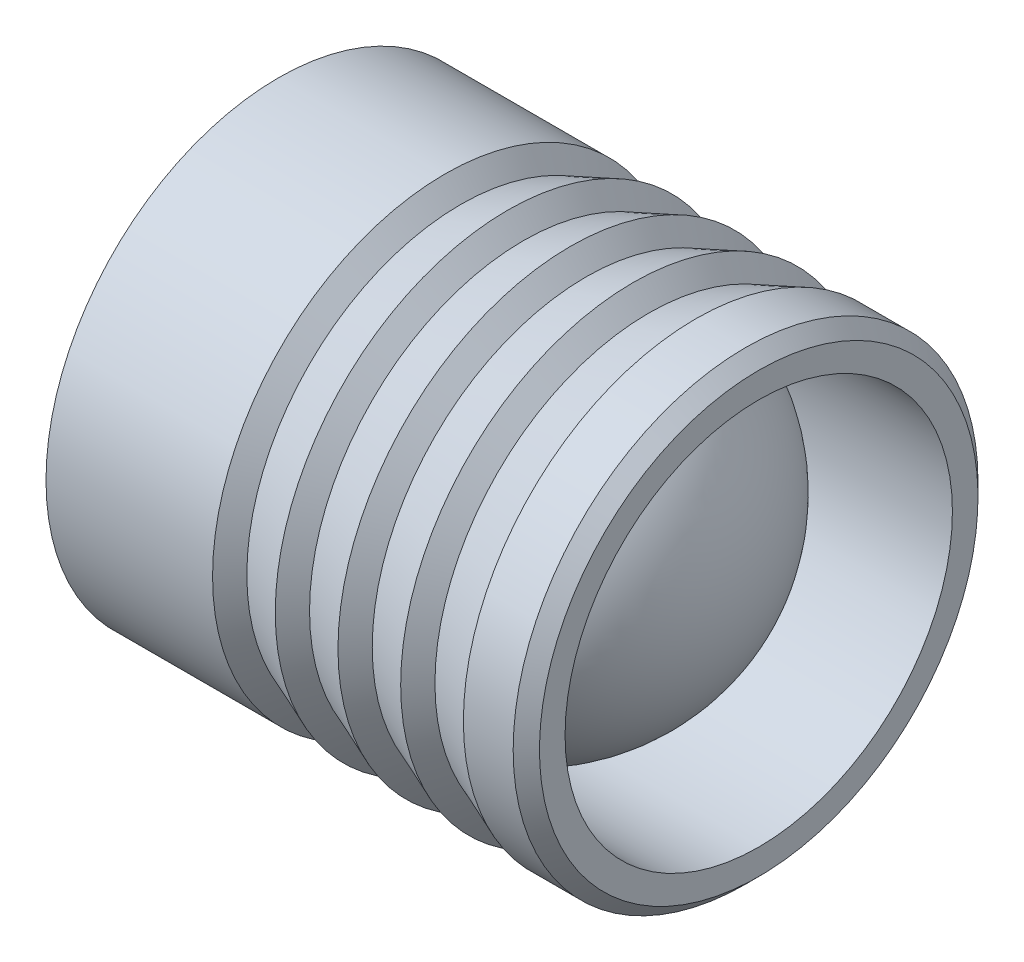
ISO-10303-21;
HEADER;
FILE_DESCRIPTION(('STEP AP214'),'2;1');
FILE_NAME('part.step','',(''),(''),'','','');
FILE_SCHEMA(('AUTOMOTIVE_DESIGN { 1 0 10303 214 1 1 1 1 }'));
ENDSEC;
DATA;
#1=APPLICATION_CONTEXT('core data for automotive mechanical design processes');
#2=APPLICATION_PROTOCOL_DEFINITION('international standard','automotive_design',2000,#1);
#3=PRODUCT_CONTEXT('',#1,'mechanical');
#4=PRODUCT('Part','Part','',(#3));
#5=PRODUCT_RELATED_PRODUCT_CATEGORY('part','',(#4));
#6=PRODUCT_DEFINITION_FORMATION('','',#4);
#7=PRODUCT_DEFINITION_CONTEXT('part definition',#1,'design');
#8=PRODUCT_DEFINITION('design','',#6,#7);
#9=PRODUCT_DEFINITION_SHAPE('','',#8);
#10=(LENGTH_UNIT() NAMED_UNIT(*) SI_UNIT(.MILLI.,.METRE.));
#11=(NAMED_UNIT(*) PLANE_ANGLE_UNIT() SI_UNIT($,.RADIAN.));
#12=(NAMED_UNIT(*) SI_UNIT($,.STERADIAN.) SOLID_ANGLE_UNIT());
#13=UNCERTAINTY_MEASURE_WITH_UNIT(LENGTH_MEASURE(1.E-05),#10,'distance_accuracy_value','');
#14=(GEOMETRIC_REPRESENTATION_CONTEXT(3) GLOBAL_UNCERTAINTY_ASSIGNED_CONTEXT((#13)) GLOBAL_UNIT_ASSIGNED_CONTEXT((#10,
#11,#12)) REPRESENTATION_CONTEXT('',''));
#15=CARTESIAN_POINT('',(0.,0.,0.));
#16=DIRECTION('',(0.,0.,1.));
#17=DIRECTION('',(1.,0.,0.));
#18=AXIS2_PLACEMENT_3D('',#15,#16,#17);
#19=CARTESIAN_POINT('',(3.59,0.,0.));
#20=DIRECTION('',(1.,0.,0.));
#21=DIRECTION('',(0.,1.,0.));
#22=AXIS2_PLACEMENT_3D('',#19,#20,#21);
#23=SPHERICAL_SURFACE('',#22,2.51);
#24=CARTESIAN_POINT('',(3.8138314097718,0.,0.));
#25=DIRECTION('',(-1.,0.,0.));
#26=DIRECTION('',(0.,-1.,0.));
#27=AXIS2_PLACEMENT_3D('',#24,#25,#26);
#28=CIRCLE('',#27,2.4999999);
#29=CARTESIAN_POINT('',(3.81383140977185,-2.49999989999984,0.));
#30=VERTEX_POINT('',#29);
#31=EDGE_CURVE('E41',#30,#30,#28,.T.);
#32=ORIENTED_EDGE('',*,*,#31,.F.);
#33=EDGE_LOOP('',(#32));
#34=FACE_BOUND('',#33,.T.);
#35=CARTESIAN_POINT('',(6.1,0.,0.));
#36=VERTEX_POINT('',#35);
#37=VERTEX_LOOP('',#36);
#38=FACE_BOUND('',#37,.T.);
#39=ADVANCED_FACE('F18',(#34,#38),#23,.T.);
#40=CARTESIAN_POINT('',(6.5,2.83029437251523,0.));
#41=DIRECTION('',(-1.,0.,0.));
#42=DIRECTION('',(0.,1.,0.));
#43=AXIS2_PLACEMENT_3D('',#40,#41,#42);
#44=PLANE('',#43);
#45=CARTESIAN_POINT('',(6.5,1.3500311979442E-13,0.));
#46=DIRECTION('',(1.,0.,0.));
#47=DIRECTION('',(0.,1.,0.));
#48=AXIS2_PLACEMENT_3D('',#45,#46,#47);
#49=CIRCLE('',#48,2.8302943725);
#50=CARTESIAN_POINT('',(6.5,2.83029437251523,0.));
#51=VERTEX_POINT('',#50);
#52=EDGE_CURVE('E11',#51,#51,#49,.T.);
#53=ORIENTED_EDGE('',*,*,#52,.T.);
#54=EDGE_LOOP('',(#53));
#55=FACE_BOUND('',#54,.T.);
#56=CARTESIAN_POINT('',(6.5,1.3500311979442E-13,0.));
#57=DIRECTION('',(1.,0.,0.));
#58=DIRECTION('',(0.,1.,0.));
#59=AXIS2_PLACEMENT_3D('',#56,#57,#58);
#60=CIRCLE('',#59,2.4999999);
#61=CARTESIAN_POINT('',(6.5,2.49999989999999,0.));
#62=VERTEX_POINT('',#61);
#63=EDGE_CURVE('E29',#62,#62,#60,.T.);
#64=ORIENTED_EDGE('',*,*,#63,.F.);
#65=EDGE_LOOP('',(#64));
#66=FACE_BOUND('',#65,.T.);
#67=ADVANCED_FACE('F174',(#55,#66),#44,.F.);
#68=CARTESIAN_POINT('',(6.5,1.35003119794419E-13,0.));
#69=DIRECTION('',(-1.,0.,0.));
#70=DIRECTION('',(0.,1.,0.));
#71=AXIS2_PLACEMENT_3D('',#68,#69,#70);
#72=CYLINDRICAL_SURFACE('',#71,2.4999999);
#73=ORIENTED_EDGE('',*,*,#63,.T.);
#74=EDGE_LOOP('',(#73));
#75=FACE_BOUND('',#74,.T.);
#76=ORIENTED_EDGE('',*,*,#31,.T.);
#77=EDGE_LOOP('',(#76));
#78=FACE_BOUND('',#77,.T.);
#79=ADVANCED_FACE('F171',(#75,#78),#72,.F.);
#80=CARTESIAN_POINT('',(0.,0.,0.));
#81=DIRECTION('',(1.,0.,0.));
#82=DIRECTION('',(0.,1.,0.));
#83=AXIS2_PLACEMENT_3D('',#80,#81,#82);
#84=PLANE('',#83);
#85=CARTESIAN_POINT('',(0.,0.,0.));
#86=DIRECTION('',(1.,0.,0.));
#87=DIRECTION('',(0.,1.,0.));
#88=AXIS2_PLACEMENT_3D('',#85,#86,#87);
#89=CIRCLE('',#88,2.4803847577);
#90=CARTESIAN_POINT('',(0.,2.48038475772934,0.));
#91=VERTEX_POINT('',#90);
#92=EDGE_CURVE('E131',#91,#91,#89,.T.);
#93=ORIENTED_EDGE('',*,*,#92,.F.);
#94=EDGE_LOOP('',(#93));
#95=FACE_BOUND('',#94,.T.);
#96=ADVANCED_FACE('F173',(#95),#84,.F.);
#97=CARTESIAN_POINT('',(6.33029437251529,1.31292870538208E-13,0.));
#98=DIRECTION('',(-1.,0.,0.));
#99=DIRECTION('',(0.,-1.,0.));
#100=AXIS2_PLACEMENT_3D('',#97,#98,#99);
#101=CONICAL_SURFACE('',#100,3.,0.7853981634);
#102=CARTESIAN_POINT('',(6.33029437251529,1.31292870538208E-13,0.));
#103=DIRECTION('',(1.,0.,0.));
#104=DIRECTION('',(0.,1.,0.));
#105=AXIS2_PLACEMENT_3D('',#102,#103,#104);
#106=CIRCLE('',#105,3.);
#107=CARTESIAN_POINT('',(6.33029437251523,3.,0.));
#108=VERTEX_POINT('',#107);
#109=EDGE_CURVE('E164',#108,#108,#106,.T.);
#110=ORIENTED_EDGE('',*,*,#109,.T.);
#111=EDGE_LOOP('',(#110));
#112=FACE_BOUND('',#111,.T.);
#113=ORIENTED_EDGE('',*,*,#52,.F.);
#114=EDGE_LOOP('',(#113));
#115=FACE_BOUND('',#114,.T.);
#116=ADVANCED_FACE('F182',(#112,#115),#101,.T.);
#117=CARTESIAN_POINT('',(6.5,1.35003119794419E-13,0.));
#118=DIRECTION('',(-1.,0.,0.));
#119=DIRECTION('',(0.,1.,0.));
#120=AXIS2_PLACEMENT_3D('',#117,#118,#119);
#121=CYLINDRICAL_SURFACE('',#120,3.);
#122=CARTESIAN_POINT('',(5.68750000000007,1.17239551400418E-13,0.));
#123=DIRECTION('',(1.,0.,0.));
#124=DIRECTION('',(0.,1.,0.));
#125=AXIS2_PLACEMENT_3D('',#122,#123,#124);
#126=CIRCLE('',#125,3.);
#127=CARTESIAN_POINT('',(5.6875,3.,0.));
#128=VERTEX_POINT('',#127);
#129=EDGE_CURVE('E130',#128,#128,#126,.T.);
#130=ORIENTED_EDGE('',*,*,#129,.T.);
#131=EDGE_LOOP('',(#130));
#132=FACE_BOUND('',#131,.T.);
#133=ORIENTED_EDGE('',*,*,#109,.F.);
#134=EDGE_LOOP('',(#133));
#135=FACE_BOUND('',#134,.T.);
#136=ADVANCED_FACE('F208',(#132,#135),#121,.T.);
#137=CARTESIAN_POINT('',(5.08046875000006,1.03968116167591E-13,0.));
#138=DIRECTION('',(1.,0.,0.));
#139=DIRECTION('',(0.,1.,0.));
#140=AXIS2_PLACEMENT_3D('',#137,#138,#139);
#141=CONICAL_SURFACE('',#140,2.76,0.376505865);
#142=ORIENTED_EDGE('',*,*,#129,.F.);
#143=EDGE_LOOP('',(#142));
#144=FACE_BOUND('',#143,.T.);
#145=CARTESIAN_POINT('',(5.08046875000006,1.03968116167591E-13,0.));
#146=DIRECTION('',(1.,0.,0.));
#147=DIRECTION('',(0.,1.,0.));
#148=AXIS2_PLACEMENT_3D('',#145,#146,#147);
#149=CIRCLE('',#148,2.76);
#150=CARTESIAN_POINT('',(5.08046875,2.76,0.));
#151=VERTEX_POINT('',#150);
#152=EDGE_CURVE('E145',#151,#151,#149,.T.);
#153=ORIENTED_EDGE('',*,*,#152,.T.);
#154=EDGE_LOOP('',(#153));
#155=FACE_BOUND('',#154,.T.);
#156=ADVANCED_FACE('F211',(#144,#155),#141,.T.);
#157=CARTESIAN_POINT('',(4.87812500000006,0.,0.));
#158=DIRECTION('',(-1.,0.,0.));
#159=DIRECTION('',(0.,-1.,0.));
#160=AXIS2_PLACEMENT_3D('',#157,#158,#159);
#161=CONICAL_SURFACE('',#160,3.,0.8703223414);
#162=CARTESIAN_POINT('',(4.87812500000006,0.,0.));
#163=DIRECTION('',(1.,0.,0.));
#164=DIRECTION('',(0.,1.,0.));
#165=AXIS2_PLACEMENT_3D('',#162,#163,#164);
#166=CIRCLE('',#165,3.);
#167=CARTESIAN_POINT('',(4.878125,3.,0.));
#168=VERTEX_POINT('',#167);
#169=EDGE_CURVE('E123',#168,#168,#166,.T.);
#170=ORIENTED_EDGE('',*,*,#169,.T.);
#171=EDGE_LOOP('',(#170));
#172=FACE_BOUND('',#171,.T.);
#173=ORIENTED_EDGE('',*,*,#152,.F.);
#174=EDGE_LOOP('',(#173));
#175=FACE_BOUND('',#174,.T.);
#176=ADVANCED_FACE('F213',(#172,#175),#161,.T.);
#177=CARTESIAN_POINT('',(4.27109375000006,0.,0.));
#178=DIRECTION('',(1.,0.,0.));
#179=DIRECTION('',(0.,1.,0.));
#180=AXIS2_PLACEMENT_3D('',#177,#178,#179);
#181=CONICAL_SURFACE('',#180,2.76,0.376505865);
#182=ORIENTED_EDGE('',*,*,#169,.F.);
#183=EDGE_LOOP('',(#182));
#184=FACE_BOUND('',#183,.T.);
#185=CARTESIAN_POINT('',(4.27109375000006,0.,0.));
#186=DIRECTION('',(1.,0.,0.));
#187=DIRECTION('',(0.,1.,0.));
#188=AXIS2_PLACEMENT_3D('',#185,#186,#187);
#189=CIRCLE('',#188,2.76);
#190=CARTESIAN_POINT('',(4.27109375,2.76,0.));
#191=VERTEX_POINT('',#190);
#192=EDGE_CURVE('E115',#191,#191,#189,.T.);
#193=ORIENTED_EDGE('',*,*,#192,.T.);
#194=EDGE_LOOP('',(#193));
#195=FACE_BOUND('',#194,.T.);
#196=ADVANCED_FACE('F216',(#184,#195),#181,.T.);
#197=CARTESIAN_POINT('',(4.06875000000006,0.,0.));
#198=DIRECTION('',(-1.,0.,0.));
#199=DIRECTION('',(0.,-1.,0.));
#200=AXIS2_PLACEMENT_3D('',#197,#198,#199);
#201=CONICAL_SURFACE('',#200,3.,0.8703223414);
#202=CARTESIAN_POINT('',(4.06875000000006,0.,0.));
#203=DIRECTION('',(1.,0.,0.));
#204=DIRECTION('',(0.,1.,0.));
#205=AXIS2_PLACEMENT_3D('',#202,#203,#204);
#206=CIRCLE('',#205,3.);
#207=CARTESIAN_POINT('',(4.06875,3.,0.));
#208=VERTEX_POINT('',#207);
#209=EDGE_CURVE('E111',#208,#208,#206,.T.);
#210=ORIENTED_EDGE('',*,*,#209,.T.);
#211=EDGE_LOOP('',(#210));
#212=FACE_BOUND('',#211,.T.);
#213=ORIENTED_EDGE('',*,*,#192,.F.);
#214=EDGE_LOOP('',(#213));
#215=FACE_BOUND('',#214,.T.);
#216=ADVANCED_FACE('F220',(#212,#215),#201,.T.);
#217=CARTESIAN_POINT('',(3.46171875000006,0.,0.));
#218=DIRECTION('',(1.,0.,0.));
#219=DIRECTION('',(0.,1.,0.));
#220=AXIS2_PLACEMENT_3D('',#217,#218,#219);
#221=CONICAL_SURFACE('',#220,2.76,0.376505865);
#222=ORIENTED_EDGE('',*,*,#209,.F.);
#223=EDGE_LOOP('',(#222));
#224=FACE_BOUND('',#223,.T.);
#225=CARTESIAN_POINT('',(3.46171875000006,0.,0.));
#226=DIRECTION('',(1.,0.,0.));
#227=DIRECTION('',(0.,1.,0.));
#228=AXIS2_PLACEMENT_3D('',#225,#226,#227);
#229=CIRCLE('',#228,2.76);
#230=CARTESIAN_POINT('',(3.46171875,2.76,0.));
#231=VERTEX_POINT('',#230);
#232=EDGE_CURVE('E116',#231,#231,#229,.T.);
#233=ORIENTED_EDGE('',*,*,#232,.T.);
#234=EDGE_LOOP('',(#233));
#235=FACE_BOUND('',#234,.T.);
#236=ADVANCED_FACE('F20',(#224,#235),#221,.T.);
#237=CARTESIAN_POINT('',(3.25937500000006,0.,0.));
#238=DIRECTION('',(-1.,0.,0.));
#239=DIRECTION('',(0.,-1.,0.));
#240=AXIS2_PLACEMENT_3D('',#237,#238,#239);
#241=CONICAL_SURFACE('',#240,3.,0.8703223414);
#242=CARTESIAN_POINT('',(3.25937500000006,0.,0.));
#243=DIRECTION('',(1.,0.,0.));
#244=DIRECTION('',(0.,1.,0.));
#245=AXIS2_PLACEMENT_3D('',#242,#243,#244);
#246=CIRCLE('',#245,3.);
#247=CARTESIAN_POINT('',(3.259375,3.,0.));
#248=VERTEX_POINT('',#247);
#249=EDGE_CURVE('E22',#248,#248,#246,.T.);
#250=ORIENTED_EDGE('',*,*,#249,.T.);
#251=EDGE_LOOP('',(#250));
#252=FACE_BOUND('',#251,.T.);
#253=ORIENTED_EDGE('',*,*,#232,.F.);
#254=EDGE_LOOP('',(#253));
#255=FACE_BOUND('',#254,.T.);
#256=ADVANCED_FACE('F230',(#252,#255),#241,.T.);
#257=CARTESIAN_POINT('',(2.65234375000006,0.,0.));
#258=DIRECTION('',(1.,0.,0.));
#259=DIRECTION('',(0.,1.,0.));
#260=AXIS2_PLACEMENT_3D('',#257,#258,#259);
#261=CONICAL_SURFACE('',#260,2.76,0.376505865);
#262=ORIENTED_EDGE('',*,*,#249,.F.);
#263=EDGE_LOOP('',(#262));
#264=FACE_BOUND('',#263,.T.);
#265=CARTESIAN_POINT('',(2.65234375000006,0.,0.));
#266=DIRECTION('',(1.,0.,0.));
#267=DIRECTION('',(0.,1.,0.));
#268=AXIS2_PLACEMENT_3D('',#265,#266,#267);
#269=CIRCLE('',#268,2.76);
#270=CARTESIAN_POINT('',(2.65234375,2.76,0.));
#271=VERTEX_POINT('',#270);
#272=EDGE_CURVE('E140',#271,#271,#269,.T.);
#273=ORIENTED_EDGE('',*,*,#272,.T.);
#274=EDGE_LOOP('',(#273));
#275=FACE_BOUND('',#274,.T.);
#276=ADVANCED_FACE('F205',(#264,#275),#261,.T.);
#277=CARTESIAN_POINT('',(2.45000000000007,0.,0.));
#278=DIRECTION('',(-1.,0.,0.));
#279=DIRECTION('',(0.,-1.,0.));
#280=AXIS2_PLACEMENT_3D('',#277,#278,#279);
#281=CONICAL_SURFACE('',#280,3.,0.8703223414);
#282=CARTESIAN_POINT('',(2.45000000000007,0.,0.));
#283=DIRECTION('',(1.,0.,0.));
#284=DIRECTION('',(0.,1.,0.));
#285=AXIS2_PLACEMENT_3D('',#282,#283,#284);
#286=CIRCLE('',#285,3.);
#287=CARTESIAN_POINT('',(2.45,3.,0.));
#288=VERTEX_POINT('',#287);
#289=EDGE_CURVE('E144',#288,#288,#286,.T.);
#290=ORIENTED_EDGE('',*,*,#289,.T.);
#291=EDGE_LOOP('',(#290));
#292=FACE_BOUND('',#291,.T.);
#293=ORIENTED_EDGE('',*,*,#272,.F.);
#294=EDGE_LOOP('',(#293));
#295=FACE_BOUND('',#294,.T.);
#296=ADVANCED_FACE('F202',(#292,#295),#281,.T.);
#297=CARTESIAN_POINT('',(6.5,1.35003119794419E-13,0.));
#298=DIRECTION('',(-1.,0.,0.));
#299=DIRECTION('',(0.,1.,0.));
#300=AXIS2_PLACEMENT_3D('',#297,#298,#299);
#301=CYLINDRICAL_SURFACE('',#300,3.);
#302=CARTESIAN_POINT('',(0.300000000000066,0.,0.));
#303=DIRECTION('',(1.,0.,0.));
#304=DIRECTION('',(0.,1.,0.));
#305=AXIS2_PLACEMENT_3D('',#302,#303,#304);
#306=CIRCLE('',#305,3.);
#307=CARTESIAN_POINT('',(0.3,3.,0.));
#308=VERTEX_POINT('',#307);
#309=EDGE_CURVE('E133',#308,#308,#306,.T.);
#310=ORIENTED_EDGE('',*,*,#309,.T.);
#311=EDGE_LOOP('',(#310));
#312=FACE_BOUND('',#311,.T.);
#313=ORIENTED_EDGE('',*,*,#289,.F.);
#314=EDGE_LOOP('',(#313));
#315=FACE_BOUND('',#314,.T.);
#316=ADVANCED_FACE('F204',(#312,#315),#301,.T.);
#317=CARTESIAN_POINT('',(0.,0.,0.));
#318=DIRECTION('',(1.,0.,0.));
#319=DIRECTION('',(0.,1.,0.));
#320=AXIS2_PLACEMENT_3D('',#317,#318,#319);
#321=CONICAL_SURFACE('',#320,2.4803847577,1.0471975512);
#322=ORIENTED_EDGE('',*,*,#309,.F.);
#323=EDGE_LOOP('',(#322));
#324=FACE_BOUND('',#323,.T.);
#325=ORIENTED_EDGE('',*,*,#92,.T.);
#326=EDGE_LOOP('',(#325));
#327=FACE_BOUND('',#326,.T.);
#328=ADVANCED_FACE('F224',(#324,#327),#321,.T.);
#329=CLOSED_SHELL('',(#39,#67,#79,#96,#116,#136,#156,#176,#196,#216,#236,#256,#276,#296,#316,#328));
#330=CARTESIAN_POINT('',(1.76837561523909,0.,0.));
#331=DIRECTION('',(1.,0.,0.));
#332=DIRECTION('',(0.,1.,0.));
#333=AXIS2_PLACEMENT_3D('',#330,#331,#332);
#334=CONICAL_SURFACE('',#333,2.4999999,1.0471975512);
#335=CARTESIAN_POINT('',(1.76837561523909,0.,0.));
#336=DIRECTION('',(1.,0.,0.));
#337=DIRECTION('',(0.,1.,0.));
#338=AXIS2_PLACEMENT_3D('',#335,#336,#337);
#339=CIRCLE('',#338,2.4999999);
#340=CARTESIAN_POINT('',(1.76837561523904,2.4999999,0.));
#341=VERTEX_POINT('',#340);
#342=EDGE_CURVE('E134',#341,#341,#339,.T.);
#343=ORIENTED_EDGE('',*,*,#342,.T.);
#344=EDGE_LOOP('',(#343));
#345=FACE_BOUND('',#344,.T.);
#346=CARTESIAN_POINT('',(0.325,0.,0.));
#347=VERTEX_POINT('',#346);
#348=VERTEX_LOOP('',#347);
#349=FACE_BOUND('',#348,.T.);
#350=ADVANCED_FACE('F197',(#345,#349),#334,.F.);
#351=CARTESIAN_POINT('',(3.59,0.,0.));
#352=DIRECTION('',(1.,0.,0.));
#353=DIRECTION('',(0.,1.,0.));
#354=AXIS2_PLACEMENT_3D('',#351,#352,#353);
#355=SPHERICAL_SURFACE('',#354,2.51);
#356=CARTESIAN_POINT('',(3.36616859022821,0.,0.));
#357=DIRECTION('',(1.,0.,0.));
#358=DIRECTION('',(0.,1.,0.));
#359=AXIS2_PLACEMENT_3D('',#356,#357,#358);
#360=CIRCLE('',#359,2.4999999);
#361=CARTESIAN_POINT('',(3.36616859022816,2.49999989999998,0.));
#362=VERTEX_POINT('',#361);
#363=EDGE_CURVE('E139',#362,#362,#360,.T.);
#364=ORIENTED_EDGE('',*,*,#363,.F.);
#365=EDGE_LOOP('',(#364));
#366=FACE_BOUND('',#365,.T.);
#367=CARTESIAN_POINT('',(1.08,0.,0.));
#368=VERTEX_POINT('',#367);
#369=VERTEX_LOOP('',#368);
#370=FACE_BOUND('',#369,.T.);
#371=ADVANCED_FACE('F196',(#366,#370),#355,.T.);
#372=CARTESIAN_POINT('',(6.5,1.35003119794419E-13,0.));
#373=DIRECTION('',(-1.,0.,0.));
#374=DIRECTION('',(0.,1.,0.));
#375=AXIS2_PLACEMENT_3D('',#372,#373,#374);
#376=CYLINDRICAL_SURFACE('',#375,2.4999999);
#377=ORIENTED_EDGE('',*,*,#363,.T.);
#378=EDGE_LOOP('',(#377));
#379=FACE_BOUND('',#378,.T.);
#380=ORIENTED_EDGE('',*,*,#342,.F.);
#381=EDGE_LOOP('',(#380));
#382=FACE_BOUND('',#381,.T.);
#383=ADVANCED_FACE('F226',(#379,#382),#376,.F.);
#384=CLOSED_SHELL('',(#350,#371,#383));
#385=ORIENTED_CLOSED_SHELL('',*,#384,.T.);
#386=BREP_WITH_VOIDS('B1',#329,(#385));
#387=ADVANCED_BREP_SHAPE_REPRESENTATION('',(#18,#386),#14);
#388=SHAPE_DEFINITION_REPRESENTATION(#9,#387);
ENDSEC;
END-ISO-10303-21;
